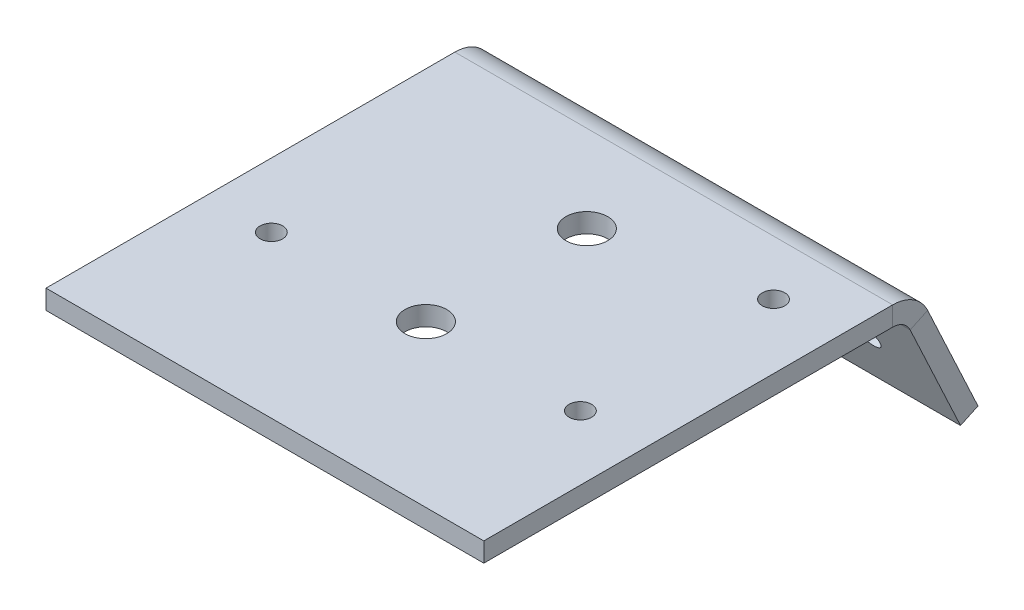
ISO-10303-21;
HEADER;
FILE_DESCRIPTION(('STEP AP214'),'2;1');
FILE_NAME('part.step','',(''),(''),'','','');
FILE_SCHEMA(('AUTOMOTIVE_DESIGN { 1 0 10303 214 1 1 1 1 }'));
ENDSEC;
DATA;
#1=APPLICATION_CONTEXT('core data for automotive mechanical design processes');
#2=APPLICATION_PROTOCOL_DEFINITION('international standard','automotive_design',2000,#1);
#3=PRODUCT_CONTEXT('',#1,'mechanical');
#4=PRODUCT('Part','Part','',(#3));
#5=PRODUCT_RELATED_PRODUCT_CATEGORY('part','',(#4));
#6=PRODUCT_DEFINITION_FORMATION('','',#4);
#7=PRODUCT_DEFINITION_CONTEXT('part definition',#1,'design');
#8=PRODUCT_DEFINITION('design','',#6,#7);
#9=PRODUCT_DEFINITION_SHAPE('','',#8);
#10=(LENGTH_UNIT() NAMED_UNIT(*) SI_UNIT(.MILLI.,.METRE.));
#11=(NAMED_UNIT(*) PLANE_ANGLE_UNIT() SI_UNIT($,.RADIAN.));
#12=(NAMED_UNIT(*) SI_UNIT($,.STERADIAN.) SOLID_ANGLE_UNIT());
#13=UNCERTAINTY_MEASURE_WITH_UNIT(LENGTH_MEASURE(1.E-05),#10,'distance_accuracy_value','');
#14=(GEOMETRIC_REPRESENTATION_CONTEXT(3) GLOBAL_UNCERTAINTY_ASSIGNED_CONTEXT((#13)) GLOBAL_UNIT_ASSIGNED_CONTEXT((#10,
#11,#12)) REPRESENTATION_CONTEXT('',''));
#15=CARTESIAN_POINT('',(0.,0.,0.));
#16=DIRECTION('',(0.,0.,1.));
#17=DIRECTION('',(1.,0.,0.));
#18=AXIS2_PLACEMENT_3D('',#15,#16,#17);
#19=CARTESIAN_POINT('',(68.,59.8051774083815,-40.8337323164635));
#20=DIRECTION('',(-1.,0.,0.));
#21=DIRECTION('',(0.,0.906307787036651,0.422618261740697));
#22=AXIS2_PLACEMENT_3D('',#19,#20,#21);
#23=PLANE('',#22);
#24=DIRECTION('',(0.,-0.906307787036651,-0.422618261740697));
#25=VECTOR('',#24,1.);
#26=CARTESIAN_POINT('',(68.,59.8051774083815,-40.8337323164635));
#27=LINE('',#26,#25);
#28=CARTESIAN_POINT('',(68.,-0.46429040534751,-68.9378467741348));
#29=VERTEX_POINT('',#28);
#30=CARTESIAN_POINT('',(68.,-17.2309844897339,-76.7562845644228));
#31=VERTEX_POINT('',#30);
#32=EDGE_CURVE('E143',#29,#31,#27,.T.);
#33=ORIENTED_EDGE('',*,*,#32,.F.);
#34=DIRECTION('',(0.,-0.422618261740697,0.906307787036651));
#35=VECTOR('',#34,1.);
#36=CARTESIAN_POINT('',(68.,-0.464290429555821,-68.9378467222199));
#37=LINE('',#36,#35);
#38=CARTESIAN_POINT('',(68.,-1.73214521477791,-66.21892336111));
#39=VERTEX_POINT('',#38);
#40=EDGE_CURVE('E12',#29,#39,#37,.T.);
#41=ORIENTED_EDGE('',*,*,#40,.T.);
#42=DIRECTION('',(0.,-0.906307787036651,-0.422618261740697));
#43=VECTOR('',#42,1.);
#44=CARTESIAN_POINT('',(68.,58.5373226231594,-38.1148089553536));
#45=LINE('',#44,#43);
#46=CARTESIAN_POINT('',(68.,-18.498839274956,-74.0373612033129));
#47=VERTEX_POINT('',#46);
#48=EDGE_CURVE('E133',#39,#47,#45,.T.);
#49=ORIENTED_EDGE('',*,*,#48,.T.);
#50=DIRECTION('',(0.,-0.422618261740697,0.906307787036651));
#51=VECTOR('',#50,1.);
#52=CARTESIAN_POINT('',(68.,-17.2309844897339,-76.7562845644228));
#53=LINE('',#52,#51);
#54=EDGE_CURVE('E155',#31,#47,#53,.T.);
#55=ORIENTED_EDGE('',*,*,#54,.F.);
#56=EDGE_LOOP('',(#33,#41,#49,#55));
#57=FACE_BOUND('',#56,.T.);
#58=ADVANCED_FACE('F40',(#57),#23,.F.);
#59=CARTESIAN_POINT('',(0.,59.8051774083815,-40.8337323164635));
#60=DIRECTION('',(1.,0.,0.));
#61=DIRECTION('',(0.,-0.906307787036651,-0.422618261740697));
#62=AXIS2_PLACEMENT_3D('',#59,#60,#61);
#63=PLANE('',#62);
#64=DIRECTION('',(0.,0.906307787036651,0.422618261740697));
#65=VECTOR('',#64,1.);
#66=CARTESIAN_POINT('',(0.,58.5373226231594,-38.1148089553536));
#67=LINE('',#66,#65);
#68=CARTESIAN_POINT('',(0.,-18.498839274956,-74.0373612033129));
#69=VERTEX_POINT('',#68);
#70=CARTESIAN_POINT('',(0.,-1.73214519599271,-66.2189234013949));
#71=VERTEX_POINT('',#70);
#72=EDGE_CURVE('E128',#69,#71,#67,.T.);
#73=ORIENTED_EDGE('',*,*,#72,.T.);
#74=DIRECTION('',(0.,0.422618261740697,-0.906307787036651));
#75=VECTOR('',#74,1.);
#76=CARTESIAN_POINT('',(0.,-0.464290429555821,-68.9378467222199));
#77=LINE('',#76,#75);
#78=CARTESIAN_POINT('',(0.,-0.46429040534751,-68.9378467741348));
#79=VERTEX_POINT('',#78);
#80=EDGE_CURVE('E108',#71,#79,#77,.T.);
#81=ORIENTED_EDGE('',*,*,#80,.T.);
#82=DIRECTION('',(0.,0.906307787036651,0.422618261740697));
#83=VECTOR('',#82,1.);
#84=CARTESIAN_POINT('',(0.,59.8051774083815,-40.8337323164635));
#85=LINE('',#84,#83);
#86=CARTESIAN_POINT('',(0.,-17.2309844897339,-76.7562845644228));
#87=VERTEX_POINT('',#86);
#88=EDGE_CURVE('E43',#87,#79,#85,.T.);
#89=ORIENTED_EDGE('',*,*,#88,.F.);
#90=DIRECTION('',(0.,-0.422618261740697,0.906307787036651));
#91=VECTOR('',#90,1.);
#92=CARTESIAN_POINT('',(0.,-17.2309844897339,-76.7562845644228));
#93=LINE('',#92,#91);
#94=EDGE_CURVE('E130',#87,#69,#93,.T.);
#95=ORIENTED_EDGE('',*,*,#94,.T.);
#96=EDGE_LOOP('',(#73,#81,#89,#95));
#97=FACE_BOUND('',#96,.T.);
#98=ADVANCED_FACE('F129',(#97),#63,.F.);
#99=CARTESIAN_POINT('',(0.,-17.2309844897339,-76.7562845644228));
#100=DIRECTION('',(0.,-0.422618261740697,0.906307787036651));
#101=DIRECTION('',(0.,-0.906307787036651,-0.422618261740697));
#102=AXIS2_PLACEMENT_3D('',#99,#100,#101);
#103=PLANE('',#102);
#104=CARTESIAN_POINT('',(10.,-8.16790661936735,-72.5301019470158));
#105=DIRECTION('',(0.,0.422618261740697,-0.906307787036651));
#106=DIRECTION('',(0.,0.906307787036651,0.422618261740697));
#107=AXIS2_PLACEMENT_3D('',#104,#105,#106);
#108=CIRCLE('',#107,1.75);
#109=CARTESIAN_POINT('',(10.,-6.58186799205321,-71.7905199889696));
#110=VERTEX_POINT('',#109);
#111=EDGE_CURVE('E134',#110,#110,#108,.T.);
#112=ORIENTED_EDGE('',*,*,#111,.F.);
#113=EDGE_LOOP('',(#112));
#114=FACE_BOUND('',#113,.T.);
#115=CARTESIAN_POINT('',(58.,-8.16790661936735,-72.5301019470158));
#116=DIRECTION('',(0.,0.422618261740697,-0.906307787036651));
#117=DIRECTION('',(0.,0.906307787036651,0.422618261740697));
#118=AXIS2_PLACEMENT_3D('',#115,#116,#117);
#119=CIRCLE('',#118,1.75);
#120=CARTESIAN_POINT('',(58.,-6.58186799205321,-71.7905199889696));
#121=VERTEX_POINT('',#120);
#122=EDGE_CURVE('E188',#121,#121,#119,.T.);
#123=ORIENTED_EDGE('',*,*,#122,.F.);
#124=EDGE_LOOP('',(#123));
#125=FACE_BOUND('',#124,.T.);
#126=ORIENTED_EDGE('',*,*,#88,.T.);
#127=DIRECTION('',(1.,0.,0.));
#128=VECTOR('',#127,1.);
#129=CARTESIAN_POINT('',(0.,-0.464290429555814,-68.9378467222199));
#130=LINE('',#129,#128);
#131=EDGE_CURVE('E118',#79,#29,#130,.T.);
#132=ORIENTED_EDGE('',*,*,#131,.T.);
#133=ORIENTED_EDGE('',*,*,#32,.T.);
#134=DIRECTION('',(-1.,0.,0.));
#135=VECTOR('',#134,1.);
#136=CARTESIAN_POINT('',(0.,-17.2309844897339,-76.7562845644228));
#137=LINE('',#136,#135);
#138=EDGE_CURVE('E63',#31,#87,#137,.T.);
#139=ORIENTED_EDGE('',*,*,#138,.T.);
#140=EDGE_LOOP('',(#126,#132,#133,#139));
#141=FACE_BOUND('',#140,.T.);
#142=ADVANCED_FACE('F156',(#114,#125,#141),#103,.F.);
#143=CARTESIAN_POINT('',(0.,-18.498839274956,-74.0373612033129));
#144=DIRECTION('',(0.,-0.422618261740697,0.906307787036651));
#145=DIRECTION('',(0.,-0.906307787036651,-0.422618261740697));
#146=AXIS2_PLACEMENT_3D('',#143,#144,#145);
#147=PLANE('',#146);
#148=DIRECTION('',(1.,0.,0.));
#149=VECTOR('',#148,1.);
#150=CARTESIAN_POINT('',(0.,-1.73214521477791,-66.21892336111));
#151=LINE('',#150,#149);
#152=EDGE_CURVE('E48',#71,#39,#151,.T.);
#153=ORIENTED_EDGE('',*,*,#152,.F.);
#154=ORIENTED_EDGE('',*,*,#72,.F.);
#155=DIRECTION('',(-1.,0.,0.));
#156=VECTOR('',#155,1.);
#157=CARTESIAN_POINT('',(0.,-18.498839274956,-74.0373612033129));
#158=LINE('',#157,#156);
#159=EDGE_CURVE('E142',#47,#69,#158,.T.);
#160=ORIENTED_EDGE('',*,*,#159,.F.);
#161=ORIENTED_EDGE('',*,*,#48,.F.);
#162=EDGE_LOOP('',(#153,#154,#160,#161));
#163=FACE_BOUND('',#162,.T.);
#164=CARTESIAN_POINT('',(58.,-9.43576140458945,-69.8111785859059));
#165=DIRECTION('',(0.,0.422618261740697,-0.906307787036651));
#166=DIRECTION('',(0.,0.906307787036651,0.422618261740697));
#167=AXIS2_PLACEMENT_3D('',#164,#165,#166);
#168=CIRCLE('',#167,1.75);
#169=CARTESIAN_POINT('',(58.,-7.8497227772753,-69.0715966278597));
#170=VERTEX_POINT('',#169);
#171=EDGE_CURVE('E191',#170,#170,#168,.T.);
#172=ORIENTED_EDGE('',*,*,#171,.T.);
#173=EDGE_LOOP('',(#172));
#174=FACE_BOUND('',#173,.T.);
#175=CARTESIAN_POINT('',(10.,-9.43576140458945,-69.8111785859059));
#176=DIRECTION('',(0.,0.422618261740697,-0.906307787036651));
#177=DIRECTION('',(0.,0.906307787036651,0.422618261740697));
#178=AXIS2_PLACEMENT_3D('',#175,#176,#177);
#179=CIRCLE('',#178,1.75);
#180=CARTESIAN_POINT('',(10.,-7.84972277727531,-69.0715966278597));
#181=VERTEX_POINT('',#180);
#182=EDGE_CURVE('E190',#181,#181,#179,.T.);
#183=ORIENTED_EDGE('',*,*,#182,.T.);
#184=EDGE_LOOP('',(#183));
#185=FACE_BOUND('',#184,.T.);
#186=ADVANCED_FACE('F137',(#163,#174,#185),#147,.T.);
#187=CARTESIAN_POINT('',(0.,-17.2309844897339,-76.7562845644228));
#188=DIRECTION('',(0.,0.906307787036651,0.422618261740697));
#189=DIRECTION('',(1.,0.,0.));
#190=AXIS2_PLACEMENT_3D('',#187,#188,#189);
#191=PLANE('',#190);
#192=ORIENTED_EDGE('',*,*,#159,.T.);
#193=ORIENTED_EDGE('',*,*,#94,.F.);
#194=ORIENTED_EDGE('',*,*,#138,.F.);
#195=ORIENTED_EDGE('',*,*,#54,.T.);
#196=EDGE_LOOP('',(#192,#193,#194,#195));
#197=FACE_BOUND('',#196,.T.);
#198=ADVANCED_FACE('F160',(#197),#191,.F.);
#199=CARTESIAN_POINT('',(10.,-8.16790661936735,-72.5301019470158));
#200=DIRECTION('',(0.,-0.422618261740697,0.906307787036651));
#201=DIRECTION('',(0.,-0.906307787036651,-0.422618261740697));
#202=AXIS2_PLACEMENT_3D('',#199,#200,#201);
#203=CYLINDRICAL_SURFACE('',#202,1.75);
#204=ORIENTED_EDGE('',*,*,#111,.T.);
#205=EDGE_LOOP('',(#204));
#206=FACE_BOUND('',#205,.T.);
#207=ORIENTED_EDGE('',*,*,#182,.F.);
#208=EDGE_LOOP('',(#207));
#209=FACE_BOUND('',#208,.T.);
#210=ADVANCED_FACE('F162',(#206,#209),#203,.F.);
#211=CARTESIAN_POINT('',(58.,-8.16790661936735,-72.5301019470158));
#212=DIRECTION('',(0.,-0.422618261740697,0.906307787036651));
#213=DIRECTION('',(0.,-0.906307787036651,-0.422618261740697));
#214=AXIS2_PLACEMENT_3D('',#211,#212,#213);
#215=CYLINDRICAL_SURFACE('',#214,1.75);
#216=ORIENTED_EDGE('',*,*,#122,.T.);
#217=EDGE_LOOP('',(#216));
#218=FACE_BOUND('',#217,.T.);
#219=ORIENTED_EDGE('',*,*,#171,.F.);
#220=EDGE_LOOP('',(#219));
#221=FACE_BOUND('',#220,.T.);
#222=ADVANCED_FACE('F168',(#218,#221),#215,.F.);
#223=CARTESIAN_POINT('',(34.,3.,-50.));
#224=DIRECTION('',(0.,-1.,0.));
#225=DIRECTION('',(0.,0.,-1.));
#226=AXIS2_PLACEMENT_3D('',#223,#224,#225);
#227=CYLINDRICAL_SURFACE('',#226,3.25);
#228=CARTESIAN_POINT('',(34.,3.,-50.));
#229=DIRECTION('',(0.,1.,0.));
#230=DIRECTION('',(0.,0.,1.));
#231=AXIS2_PLACEMENT_3D('',#228,#229,#230);
#232=CIRCLE('',#231,3.25);
#233=CARTESIAN_POINT('',(34.,3.,-46.75));
#234=VERTEX_POINT('',#233);
#235=EDGE_CURVE('E207',#234,#234,#232,.T.);
#236=ORIENTED_EDGE('',*,*,#235,.T.);
#237=EDGE_LOOP('',(#236));
#238=FACE_BOUND('',#237,.T.);
#239=CARTESIAN_POINT('',(34.,0.,-50.));
#240=DIRECTION('',(0.,1.,0.));
#241=DIRECTION('',(0.,0.,1.));
#242=AXIS2_PLACEMENT_3D('',#239,#240,#241);
#243=CIRCLE('',#242,3.25);
#244=CARTESIAN_POINT('',(34.,0.,-46.75));
#245=VERTEX_POINT('',#244);
#246=EDGE_CURVE('E247',#245,#245,#243,.T.);
#247=ORIENTED_EDGE('',*,*,#246,.F.);
#248=EDGE_LOOP('',(#247));
#249=FACE_BOUND('',#248,.T.);
#250=ADVANCED_FACE('F294',(#238,#249),#227,.F.);
#251=CARTESIAN_POINT('',(58.,3.,-55.));
#252=DIRECTION('',(0.,-1.,0.));
#253=DIRECTION('',(0.,0.,-1.));
#254=AXIS2_PLACEMENT_3D('',#251,#252,#253);
#255=CYLINDRICAL_SURFACE('',#254,1.75);
#256=CARTESIAN_POINT('',(58.,3.,-55.));
#257=DIRECTION('',(0.,1.,0.));
#258=DIRECTION('',(0.,0.,1.));
#259=AXIS2_PLACEMENT_3D('',#256,#257,#258);
#260=CIRCLE('',#259,1.75);
#261=CARTESIAN_POINT('',(58.,3.,-53.25));
#262=VERTEX_POINT('',#261);
#263=EDGE_CURVE('E210',#262,#262,#260,.T.);
#264=ORIENTED_EDGE('',*,*,#263,.T.);
#265=EDGE_LOOP('',(#264));
#266=FACE_BOUND('',#265,.T.);
#267=CARTESIAN_POINT('',(58.,0.,-55.));
#268=DIRECTION('',(0.,1.,0.));
#269=DIRECTION('',(0.,0.,1.));
#270=AXIS2_PLACEMENT_3D('',#267,#268,#269);
#271=CIRCLE('',#270,1.75);
#272=CARTESIAN_POINT('',(58.,0.,-53.25));
#273=VERTEX_POINT('',#272);
#274=EDGE_CURVE('E244',#273,#273,#271,.T.);
#275=ORIENTED_EDGE('',*,*,#274,.F.);
#276=EDGE_LOOP('',(#275));
#277=FACE_BOUND('',#276,.T.);
#278=ADVANCED_FACE('F298',(#266,#277),#255,.F.);
#279=CARTESIAN_POINT('',(10.,3.,-25.));
#280=DIRECTION('',(0.,-1.,0.));
#281=DIRECTION('',(0.,0.,-1.));
#282=AXIS2_PLACEMENT_3D('',#279,#280,#281);
#283=CYLINDRICAL_SURFACE('',#282,1.75);
#284=CARTESIAN_POINT('',(10.,3.,-25.));
#285=DIRECTION('',(0.,1.,0.));
#286=DIRECTION('',(0.,0.,1.));
#287=AXIS2_PLACEMENT_3D('',#284,#285,#286);
#288=CIRCLE('',#287,1.75);
#289=CARTESIAN_POINT('',(10.,3.,-23.25));
#290=VERTEX_POINT('',#289);
#291=EDGE_CURVE('E213',#290,#290,#288,.T.);
#292=ORIENTED_EDGE('',*,*,#291,.T.);
#293=EDGE_LOOP('',(#292));
#294=FACE_BOUND('',#293,.T.);
#295=CARTESIAN_POINT('',(10.,0.,-25.));
#296=DIRECTION('',(0.,1.,0.));
#297=DIRECTION('',(0.,0.,1.));
#298=AXIS2_PLACEMENT_3D('',#295,#296,#297);
#299=CIRCLE('',#298,1.75);
#300=CARTESIAN_POINT('',(10.,0.,-23.25));
#301=VERTEX_POINT('',#300);
#302=EDGE_CURVE('E241',#301,#301,#299,.T.);
#303=ORIENTED_EDGE('',*,*,#302,.F.);
#304=EDGE_LOOP('',(#303));
#305=FACE_BOUND('',#304,.T.);
#306=ADVANCED_FACE('F309',(#294,#305),#283,.F.);
#307=CARTESIAN_POINT('',(58.,3.,-25.));
#308=DIRECTION('',(0.,-1.,0.));
#309=DIRECTION('',(0.,0.,-1.));
#310=AXIS2_PLACEMENT_3D('',#307,#308,#309);
#311=CYLINDRICAL_SURFACE('',#310,1.75);
#312=CARTESIAN_POINT('',(58.,3.,-25.));
#313=DIRECTION('',(0.,1.,0.));
#314=DIRECTION('',(0.,0.,1.));
#315=AXIS2_PLACEMENT_3D('',#312,#313,#314);
#316=CIRCLE('',#315,1.75);
#317=CARTESIAN_POINT('',(58.,3.,-23.25));
#318=VERTEX_POINT('',#317);
#319=EDGE_CURVE('E216',#318,#318,#316,.T.);
#320=ORIENTED_EDGE('',*,*,#319,.T.);
#321=EDGE_LOOP('',(#320));
#322=FACE_BOUND('',#321,.T.);
#323=CARTESIAN_POINT('',(58.,0.,-25.));
#324=DIRECTION('',(0.,1.,0.));
#325=DIRECTION('',(0.,0.,1.));
#326=AXIS2_PLACEMENT_3D('',#323,#324,#325);
#327=CIRCLE('',#326,1.75);
#328=CARTESIAN_POINT('',(58.,0.,-23.25));
#329=VERTEX_POINT('',#328);
#330=EDGE_CURVE('E238',#329,#329,#327,.T.);
#331=ORIENTED_EDGE('',*,*,#330,.F.);
#332=EDGE_LOOP('',(#331));
#333=FACE_BOUND('',#332,.T.);
#334=ADVANCED_FACE('F318',(#322,#333),#311,.F.);
#335=CARTESIAN_POINT('',(34.,3.,-25.));
#336=DIRECTION('',(0.,-1.,0.));
#337=DIRECTION('',(0.,0.,-1.));
#338=AXIS2_PLACEMENT_3D('',#335,#336,#337);
#339=CYLINDRICAL_SURFACE('',#338,3.25);
#340=CARTESIAN_POINT('',(34.,3.,-25.));
#341=DIRECTION('',(0.,1.,0.));
#342=DIRECTION('',(0.,0.,1.));
#343=AXIS2_PLACEMENT_3D('',#340,#341,#342);
#344=CIRCLE('',#343,3.25);
#345=CARTESIAN_POINT('',(34.,3.,-21.75));
#346=VERTEX_POINT('',#345);
#347=EDGE_CURVE('E219',#346,#346,#344,.T.);
#348=ORIENTED_EDGE('',*,*,#347,.T.);
#349=EDGE_LOOP('',(#348));
#350=FACE_BOUND('',#349,.T.);
#351=CARTESIAN_POINT('',(34.,0.,-25.));
#352=DIRECTION('',(0.,1.,0.));
#353=DIRECTION('',(0.,0.,1.));
#354=AXIS2_PLACEMENT_3D('',#351,#352,#353);
#355=CIRCLE('',#354,3.25);
#356=CARTESIAN_POINT('',(34.,0.,-21.75));
#357=VERTEX_POINT('',#356);
#358=EDGE_CURVE('E235',#357,#357,#355,.T.);
#359=ORIENTED_EDGE('',*,*,#358,.F.);
#360=EDGE_LOOP('',(#359));
#361=FACE_BOUND('',#360,.T.);
#362=ADVANCED_FACE('F322',(#350,#361),#339,.F.);
#363=CARTESIAN_POINT('',(0.,3.,0.));
#364=DIRECTION('',(0.,0.,-1.));
#365=DIRECTION('',(-1.,0.,0.));
#366=AXIS2_PLACEMENT_3D('',#363,#364,#365);
#367=PLANE('',#366);
#368=DIRECTION('',(1.,0.,0.));
#369=VECTOR('',#368,1.);
#370=CARTESIAN_POINT('',(0.,0.,0.));
#371=LINE('',#370,#369);
#372=CARTESIAN_POINT('',(0.,0.,0.));
#373=VERTEX_POINT('',#372);
#374=CARTESIAN_POINT('',(68.,0.,0.));
#375=VERTEX_POINT('',#374);
#376=EDGE_CURVE('E222',#373,#375,#371,.T.);
#377=ORIENTED_EDGE('',*,*,#376,.T.);
#378=DIRECTION('',(0.,-1.,0.));
#379=VECTOR('',#378,1.);
#380=CARTESIAN_POINT('',(68.,3.,0.));
#381=LINE('',#380,#379);
#382=CARTESIAN_POINT('',(68.,3.,0.));
#383=VERTEX_POINT('',#382);
#384=EDGE_CURVE('E251',#383,#375,#381,.T.);
#385=ORIENTED_EDGE('',*,*,#384,.F.);
#386=DIRECTION('',(1.,0.,0.));
#387=VECTOR('',#386,1.);
#388=CARTESIAN_POINT('',(0.,3.,0.));
#389=LINE('',#388,#387);
#390=CARTESIAN_POINT('',(0.,3.,0.));
#391=VERTEX_POINT('',#390);
#392=EDGE_CURVE('E229',#391,#383,#389,.T.);
#393=ORIENTED_EDGE('',*,*,#392,.F.);
#394=DIRECTION('',(0.,-1.,0.));
#395=VECTOR('',#394,1.);
#396=CARTESIAN_POINT('',(0.,3.,0.));
#397=LINE('',#396,#395);
#398=EDGE_CURVE('E224',#391,#373,#397,.T.);
#399=ORIENTED_EDGE('',*,*,#398,.T.);
#400=EDGE_LOOP('',(#377,#385,#393,#399));
#401=FACE_BOUND('',#400,.T.);
#402=ADVANCED_FACE('F277',(#401),#367,.F.);
#403=CARTESIAN_POINT('',(0.,3.,-85.));
#404=DIRECTION('',(0.,-1.,0.));
#405=DIRECTION('',(0.,0.,-1.));
#406=AXIS2_PLACEMENT_3D('',#403,#404,#405);
#407=PLANE('',#406);
#408=DIRECTION('',(1.,0.,0.));
#409=VECTOR('',#408,1.);
#410=CARTESIAN_POINT('',(0.,3.,-63.5));
#411=LINE('',#410,#409);
#412=CARTESIAN_POINT('',(0.,3.00000003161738,-63.5));
#413=VERTEX_POINT('',#412);
#414=CARTESIAN_POINT('',(68.,3.,-63.5));
#415=VERTEX_POINT('',#414);
#416=EDGE_CURVE('E198',#413,#415,#411,.T.);
#417=ORIENTED_EDGE('',*,*,#416,.F.);
#418=DIRECTION('',(0.,0.,1.));
#419=VECTOR('',#418,1.);
#420=CARTESIAN_POINT('',(0.,3.,0.));
#421=LINE('',#420,#419);
#422=EDGE_CURVE('E227',#413,#391,#421,.T.);
#423=ORIENTED_EDGE('',*,*,#422,.T.);
#424=ORIENTED_EDGE('',*,*,#392,.T.);
#425=DIRECTION('',(0.,0.,-1.));
#426=VECTOR('',#425,1.);
#427=CARTESIAN_POINT('',(68.,3.,0.));
#428=LINE('',#427,#426);
#429=EDGE_CURVE('E231',#383,#415,#428,.T.);
#430=ORIENTED_EDGE('',*,*,#429,.T.);
#431=EDGE_LOOP('',(#417,#423,#424,#430));
#432=FACE_BOUND('',#431,.T.);
#433=ORIENTED_EDGE('',*,*,#347,.F.);
#434=EDGE_LOOP('',(#433));
#435=FACE_BOUND('',#434,.T.);
#436=ORIENTED_EDGE('',*,*,#319,.F.);
#437=EDGE_LOOP('',(#436));
#438=FACE_BOUND('',#437,.T.);
#439=ORIENTED_EDGE('',*,*,#291,.F.);
#440=EDGE_LOOP('',(#439));
#441=FACE_BOUND('',#440,.T.);
#442=ORIENTED_EDGE('',*,*,#263,.F.);
#443=EDGE_LOOP('',(#442));
#444=FACE_BOUND('',#443,.T.);
#445=ORIENTED_EDGE('',*,*,#235,.F.);
#446=EDGE_LOOP('',(#445));
#447=FACE_BOUND('',#446,.T.);
#448=ADVANCED_FACE('F268',(#432,#435,#438,#441,#444,#447),#407,.F.);
#449=CARTESIAN_POINT('',(0.,3.,0.));
#450=DIRECTION('',(1.,0.,0.));
#451=DIRECTION('',(0.,0.,-1.));
#452=AXIS2_PLACEMENT_3D('',#449,#450,#451);
#453=PLANE('',#452);
#454=DIRECTION('',(0.,1.,0.));
#455=VECTOR('',#454,1.);
#456=CARTESIAN_POINT('',(0.,3.,-63.5));
#457=LINE('',#456,#455);
#458=CARTESIAN_POINT('',(0.,0.,-63.5));
#459=VERTEX_POINT('',#458);
#460=EDGE_CURVE('E205',#459,#413,#457,.T.);
#461=ORIENTED_EDGE('',*,*,#460,.F.);
#462=DIRECTION('',(0.,0.,1.));
#463=VECTOR('',#462,1.);
#464=CARTESIAN_POINT('',(0.,0.,0.));
#465=LINE('',#464,#463);
#466=EDGE_CURVE('E233',#459,#373,#465,.T.);
#467=ORIENTED_EDGE('',*,*,#466,.T.);
#468=ORIENTED_EDGE('',*,*,#398,.F.);
#469=ORIENTED_EDGE('',*,*,#422,.F.);
#470=EDGE_LOOP('',(#461,#467,#468,#469));
#471=FACE_BOUND('',#470,.T.);
#472=ADVANCED_FACE('F273',(#471),#453,.F.);
#473=CARTESIAN_POINT('',(0.,0.,-85.));
#474=DIRECTION('',(0.,-1.,0.));
#475=DIRECTION('',(0.,0.,-1.));
#476=AXIS2_PLACEMENT_3D('',#473,#474,#475);
#477=PLANE('',#476);
#478=ORIENTED_EDGE('',*,*,#358,.T.);
#479=EDGE_LOOP('',(#478));
#480=FACE_BOUND('',#479,.T.);
#481=ORIENTED_EDGE('',*,*,#330,.T.);
#482=EDGE_LOOP('',(#481));
#483=FACE_BOUND('',#482,.T.);
#484=ORIENTED_EDGE('',*,*,#302,.T.);
#485=EDGE_LOOP('',(#484));
#486=FACE_BOUND('',#485,.T.);
#487=ORIENTED_EDGE('',*,*,#274,.T.);
#488=EDGE_LOOP('',(#487));
#489=FACE_BOUND('',#488,.T.);
#490=ORIENTED_EDGE('',*,*,#246,.T.);
#491=EDGE_LOOP('',(#490));
#492=FACE_BOUND('',#491,.T.);
#493=ORIENTED_EDGE('',*,*,#466,.F.);
#494=DIRECTION('',(1.,0.,0.));
#495=VECTOR('',#494,1.);
#496=CARTESIAN_POINT('',(0.,0.,-63.5));
#497=LINE('',#496,#495);
#498=CARTESIAN_POINT('',(68.,0.,-63.5));
#499=VERTEX_POINT('',#498);
#500=EDGE_CURVE('E123',#459,#499,#497,.T.);
#501=ORIENTED_EDGE('',*,*,#500,.T.);
#502=DIRECTION('',(0.,0.,-1.));
#503=VECTOR('',#502,1.);
#504=CARTESIAN_POINT('',(68.,0.,0.));
#505=LINE('',#504,#503);
#506=EDGE_CURVE('E195',#375,#499,#505,.T.);
#507=ORIENTED_EDGE('',*,*,#506,.F.);
#508=ORIENTED_EDGE('',*,*,#376,.F.);
#509=EDGE_LOOP('',(#493,#501,#507,#508));
#510=FACE_BOUND('',#509,.T.);
#511=ADVANCED_FACE('F280',(#480,#483,#486,#489,#492,#510),#477,.T.);
#512=CARTESIAN_POINT('',(68.,3.,0.));
#513=DIRECTION('',(-1.,0.,0.));
#514=DIRECTION('',(0.,0.,1.));
#515=AXIS2_PLACEMENT_3D('',#512,#513,#514);
#516=PLANE('',#515);
#517=DIRECTION('',(0.,-1.,0.));
#518=VECTOR('',#517,1.);
#519=CARTESIAN_POINT('',(68.,3.,-63.5));
#520=LINE('',#519,#518);
#521=EDGE_CURVE('E201',#415,#499,#520,.T.);
#522=ORIENTED_EDGE('',*,*,#521,.F.);
#523=ORIENTED_EDGE('',*,*,#429,.F.);
#524=ORIENTED_EDGE('',*,*,#384,.T.);
#525=ORIENTED_EDGE('',*,*,#506,.T.);
#526=EDGE_LOOP('',(#522,#523,#524,#525));
#527=FACE_BOUND('',#526,.T.);
#528=ADVANCED_FACE('F263',(#527),#516,.F.);
#529=CARTESIAN_POINT('',(0.,-3.00000004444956,-63.5));
#530=DIRECTION('',(-1.,0.,0.));
#531=DIRECTION('',(0.,0.,1.));
#532=AXIS2_PLACEMENT_3D('',#529,#530,#531);
#533=PLANE('',#532);
#534=ORIENTED_EDGE('',*,*,#80,.F.);
#535=CARTESIAN_POINT('',(0.,-3.,-63.5));
#536=DIRECTION('',(-1.,0.,0.));
#537=DIRECTION('',(0.,0.,1.));
#538=AXIS2_PLACEMENT_3D('',#535,#536,#537);
#539=CIRCLE('',#538,3.00000004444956);
#540=EDGE_CURVE('E111',#71,#459,#539,.F.);
#541=ORIENTED_EDGE('',*,*,#540,.T.);
#542=ORIENTED_EDGE('',*,*,#460,.T.);
#543=CARTESIAN_POINT('',(0.,-3.00000004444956,-63.5));
#544=DIRECTION('',(1.,0.,0.));
#545=DIRECTION('',(0.,0.,-1.));
#546=AXIS2_PLACEMENT_3D('',#543,#544,#545);
#547=CIRCLE('',#546,6.00000007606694);
#548=EDGE_CURVE('E113',#79,#413,#547,.T.);
#549=ORIENTED_EDGE('',*,*,#548,.F.);
#550=EDGE_LOOP('',(#534,#541,#542,#549));
#551=FACE_BOUND('',#550,.T.);
#552=ADVANCED_FACE('F109',(#551),#533,.T.);
#553=CARTESIAN_POINT('',(68.,-3.00000004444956,-63.5));
#554=DIRECTION('',(1.,0.,0.));
#555=DIRECTION('',(0.,0.,-1.));
#556=AXIS2_PLACEMENT_3D('',#553,#554,#555);
#557=PLANE('',#556);
#558=ORIENTED_EDGE('',*,*,#521,.T.);
#559=CARTESIAN_POINT('',(68.,-3.,-63.5));
#560=DIRECTION('',(-1.,0.,0.));
#561=DIRECTION('',(0.,0.,1.));
#562=AXIS2_PLACEMENT_3D('',#559,#560,#561);
#563=CIRCLE('',#562,3.00000004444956);
#564=EDGE_CURVE('E124',#499,#39,#563,.T.);
#565=ORIENTED_EDGE('',*,*,#564,.T.);
#566=ORIENTED_EDGE('',*,*,#40,.F.);
#567=CARTESIAN_POINT('',(68.,-3.00000004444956,-63.5));
#568=DIRECTION('',(-1.,0.,0.));
#569=DIRECTION('',(0.,0.,1.));
#570=AXIS2_PLACEMENT_3D('',#567,#568,#569);
#571=CIRCLE('',#570,6.00000007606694);
#572=EDGE_CURVE('E202',#415,#29,#571,.T.);
#573=ORIENTED_EDGE('',*,*,#572,.F.);
#574=EDGE_LOOP('',(#558,#565,#566,#573));
#575=FACE_BOUND('',#574,.T.);
#576=ADVANCED_FACE('F258',(#575),#557,.T.);
#577=CARTESIAN_POINT('',(102.132224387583,-3.,-63.5));
#578=DIRECTION('',(-1.,0.,0.));
#579=DIRECTION('',(0.,0.,1.));
#580=AXIS2_PLACEMENT_3D('',#577,#578,#579);
#581=CYLINDRICAL_SURFACE('',#580,6.00000004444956);
#582=ORIENTED_EDGE('',*,*,#572,.T.);
#583=ORIENTED_EDGE('',*,*,#131,.F.);
#584=ORIENTED_EDGE('',*,*,#548,.T.);
#585=ORIENTED_EDGE('',*,*,#416,.T.);
#586=EDGE_LOOP('',(#582,#583,#584,#585));
#587=FACE_BOUND('',#586,.T.);
#588=ADVANCED_FACE('F266',(#587),#581,.T.);
#589=CARTESIAN_POINT('',(102.132224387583,-3.,-63.5));
#590=DIRECTION('',(-1.,0.,0.));
#591=DIRECTION('',(0.,0.,1.));
#592=AXIS2_PLACEMENT_3D('',#589,#590,#591);
#593=CYLINDRICAL_SURFACE('',#592,3.00000004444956);
#594=ORIENTED_EDGE('',*,*,#564,.F.);
#595=ORIENTED_EDGE('',*,*,#500,.F.);
#596=ORIENTED_EDGE('',*,*,#540,.F.);
#597=ORIENTED_EDGE('',*,*,#152,.T.);
#598=EDGE_LOOP('',(#594,#595,#596,#597));
#599=FACE_BOUND('',#598,.T.);
#600=ADVANCED_FACE('F121',(#599),#593,.F.);
#601=CLOSED_SHELL('',(#58,#98,#142,#186,#198,#210,#222,#250,#278,#306,#334,#362,#402,#448,#472,
#511,#528,#552,#576,#588,#600));
#602=MANIFOLD_SOLID_BREP('B2',#601);
#603=ADVANCED_BREP_SHAPE_REPRESENTATION('',(#18,#602),#14);
#604=SHAPE_DEFINITION_REPRESENTATION(#9,#603);
ENDSEC;
END-ISO-10303-21;
